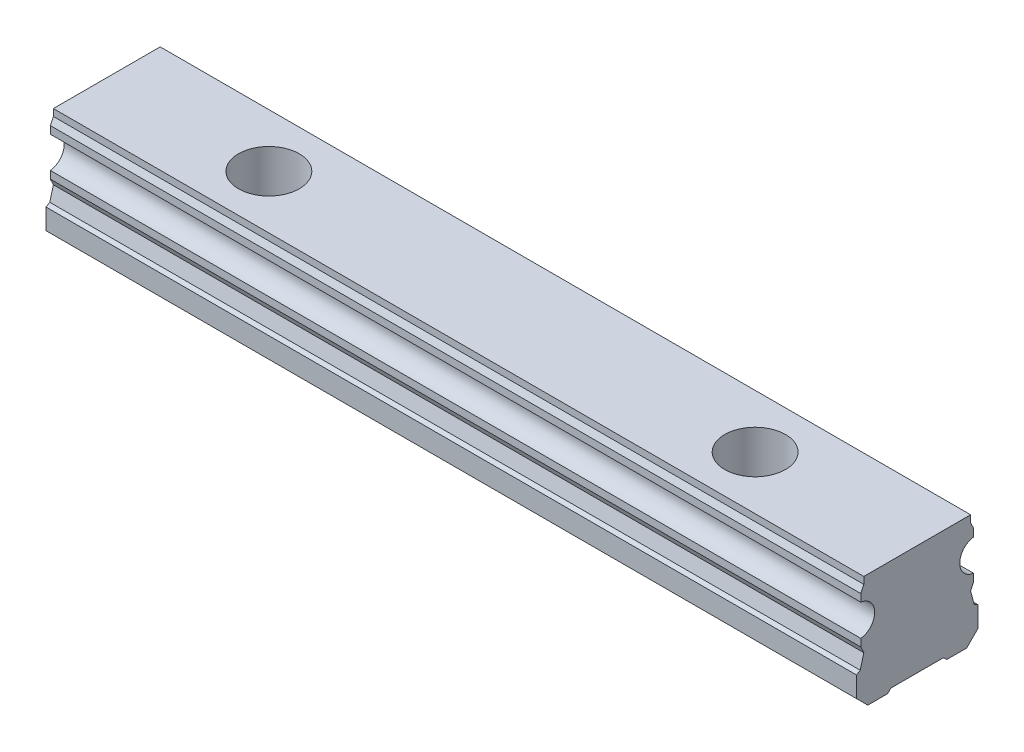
ISO-10303-21;
HEADER;
FILE_DESCRIPTION(('STEP AP214'),'2;1');
FILE_NAME('part.step','',(''),(''),'','','');
FILE_SCHEMA(('AUTOMOTIVE_DESIGN { 1 0 10303 214 1 1 1 1 }'));
ENDSEC;
DATA;
#1=APPLICATION_CONTEXT('core data for automotive mechanical design processes');
#2=APPLICATION_PROTOCOL_DEFINITION('international standard','automotive_design',2000,#1);
#3=PRODUCT_CONTEXT('',#1,'mechanical');
#4=PRODUCT('Part','Part','',(#3));
#5=PRODUCT_RELATED_PRODUCT_CATEGORY('part','',(#4));
#6=PRODUCT_DEFINITION_FORMATION('','',#4);
#7=PRODUCT_DEFINITION_CONTEXT('part definition',#1,'design');
#8=PRODUCT_DEFINITION('design','',#6,#7);
#9=PRODUCT_DEFINITION_SHAPE('','',#8);
#10=(LENGTH_UNIT() NAMED_UNIT(*) SI_UNIT(.MILLI.,.METRE.));
#11=(NAMED_UNIT(*) PLANE_ANGLE_UNIT() SI_UNIT($,.RADIAN.));
#12=(NAMED_UNIT(*) SI_UNIT($,.STERADIAN.) SOLID_ANGLE_UNIT());
#13=UNCERTAINTY_MEASURE_WITH_UNIT(LENGTH_MEASURE(1.E-05),#10,'distance_accuracy_value','');
#14=(GEOMETRIC_REPRESENTATION_CONTEXT(3) GLOBAL_UNCERTAINTY_ASSIGNED_CONTEXT((#13)) GLOBAL_UNIT_ASSIGNED_CONTEXT((#10,
#11,#12)) REPRESENTATION_CONTEXT('',''));
#15=CARTESIAN_POINT('',(0.,0.,0.));
#16=DIRECTION('',(0.,0.,1.));
#17=DIRECTION('',(1.,0.,0.));
#18=AXIS2_PLACEMENT_3D('',#15,#16,#17);
#19=CARTESIAN_POINT('',(100.,14.,-6.59000000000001));
#20=DIRECTION('',(0.,0.,1.));
#21=DIRECTION('',(0.,-1.,0.));
#22=AXIS2_PLACEMENT_3D('',#19,#20,#21);
#23=PLANE('',#22);
#24=DIRECTION('',(0.,1.,0.));
#25=VECTOR('',#24,1.);
#26=CARTESIAN_POINT('',(0.,14.,-6.59000000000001));
#27=LINE('',#26,#25);
#28=CARTESIAN_POINT('',(0.,13.15,-6.59));
#29=VERTEX_POINT('',#28);
#30=CARTESIAN_POINT('',(0.,14.,-6.59000000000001));
#31=VERTEX_POINT('',#30);
#32=EDGE_CURVE('E253',#29,#31,#27,.T.);
#33=ORIENTED_EDGE('',*,*,#32,.T.);
#34=DIRECTION('',(-1.,0.,0.));
#35=VECTOR('',#34,1.);
#36=CARTESIAN_POINT('',(100.,14.,-6.59000000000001));
#37=LINE('',#36,#35);
#38=CARTESIAN_POINT('',(100.,14.,-6.59000000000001));
#39=VERTEX_POINT('',#38);
#40=EDGE_CURVE('E421',#39,#31,#37,.T.);
#41=ORIENTED_EDGE('',*,*,#40,.F.);
#42=DIRECTION('',(0.,1.,0.));
#43=VECTOR('',#42,1.);
#44=CARTESIAN_POINT('',(100.,14.,-6.59000000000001));
#45=LINE('',#44,#43);
#46=CARTESIAN_POINT('',(100.,13.15,-6.59));
#47=VERTEX_POINT('',#46);
#48=EDGE_CURVE('E330',#47,#39,#45,.T.);
#49=ORIENTED_EDGE('',*,*,#48,.F.);
#50=DIRECTION('',(-1.,0.,0.));
#51=VECTOR('',#50,1.);
#52=CARTESIAN_POINT('',(100.,13.15,-6.59));
#53=LINE('',#52,#51);
#54=EDGE_CURVE('E249',#47,#29,#53,.T.);
#55=ORIENTED_EDGE('',*,*,#54,.T.);
#56=EDGE_LOOP('',(#33,#41,#49,#55));
#57=FACE_BOUND('',#56,.T.);
#58=ADVANCED_FACE('F38',(#57),#23,.F.);
#59=CARTESIAN_POINT('',(100.,14.,-6.59000000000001));
#60=DIRECTION('',(0.,-1.,0.));
#61=DIRECTION('',(0.,0.,-1.));
#62=AXIS2_PLACEMENT_3D('',#59,#60,#61);
#63=PLANE('',#62);
#64=CARTESIAN_POINT('',(80.,14.,0.));
#65=DIRECTION('',(0.,1.,0.));
#66=DIRECTION('',(0.,0.,1.));
#67=AXIS2_PLACEMENT_3D('',#64,#65,#66);
#68=CIRCLE('',#67,3.75);
#69=CARTESIAN_POINT('',(80.,14.,3.75));
#70=VERTEX_POINT('',#69);
#71=EDGE_CURVE('E603',#70,#70,#68,.T.);
#72=ORIENTED_EDGE('',*,*,#71,.F.);
#73=EDGE_LOOP('',(#72));
#74=FACE_BOUND('',#73,.T.);
#75=CARTESIAN_POINT('',(20.,14.,0.));
#76=DIRECTION('',(0.,1.,0.));
#77=DIRECTION('',(0.,0.,1.));
#78=AXIS2_PLACEMENT_3D('',#75,#76,#77);
#79=CIRCLE('',#78,3.75);
#80=CARTESIAN_POINT('',(20.,14.,3.75));
#81=VERTEX_POINT('',#80);
#82=EDGE_CURVE('E616',#81,#81,#79,.T.);
#83=ORIENTED_EDGE('',*,*,#82,.F.);
#84=EDGE_LOOP('',(#83));
#85=FACE_BOUND('',#84,.T.);
#86=DIRECTION('',(0.,0.,1.));
#87=VECTOR('',#86,1.);
#88=CARTESIAN_POINT('',(0.,14.,-6.59000000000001));
#89=LINE('',#88,#87);
#90=CARTESIAN_POINT('',(0.,14.,6.59));
#91=VERTEX_POINT('',#90);
#92=EDGE_CURVE('E257',#31,#91,#89,.T.);
#93=ORIENTED_EDGE('',*,*,#92,.T.);
#94=DIRECTION('',(-1.,0.,0.));
#95=VECTOR('',#94,1.);
#96=CARTESIAN_POINT('',(100.,14.,6.59));
#97=LINE('',#96,#95);
#98=CARTESIAN_POINT('',(100.,14.,6.59));
#99=VERTEX_POINT('',#98);
#100=EDGE_CURVE('E417',#99,#91,#97,.T.);
#101=ORIENTED_EDGE('',*,*,#100,.F.);
#102=DIRECTION('',(0.,0.,1.));
#103=VECTOR('',#102,1.);
#104=CARTESIAN_POINT('',(100.,14.,-6.59000000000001));
#105=LINE('',#104,#103);
#106=EDGE_CURVE('E155',#39,#99,#105,.T.);
#107=ORIENTED_EDGE('',*,*,#106,.F.);
#108=ORIENTED_EDGE('',*,*,#40,.T.);
#109=EDGE_LOOP('',(#93,#101,#107,#108));
#110=FACE_BOUND('',#109,.T.);
#111=ADVANCED_FACE('F450',(#74,#85,#110),#63,.F.);
#112=CARTESIAN_POINT('',(100.,14.,6.59));
#113=DIRECTION('',(0.,0.,-1.));
#114=DIRECTION('',(0.,1.,0.));
#115=AXIS2_PLACEMENT_3D('',#112,#113,#114);
#116=PLANE('',#115);
#117=DIRECTION('',(0.,-1.,0.));
#118=VECTOR('',#117,1.);
#119=CARTESIAN_POINT('',(0.,14.,6.59));
#120=LINE('',#119,#118);
#121=CARTESIAN_POINT('',(0.,13.15,6.59));
#122=VERTEX_POINT('',#121);
#123=EDGE_CURVE('E261',#91,#122,#120,.T.);
#124=ORIENTED_EDGE('',*,*,#123,.T.);
#125=DIRECTION('',(-1.,0.,0.));
#126=VECTOR('',#125,1.);
#127=CARTESIAN_POINT('',(100.,13.15,6.59));
#128=LINE('',#127,#126);
#129=CARTESIAN_POINT('',(100.,13.15,6.59));
#130=VERTEX_POINT('',#129);
#131=EDGE_CURVE('E413',#130,#122,#128,.T.);
#132=ORIENTED_EDGE('',*,*,#131,.F.);
#133=DIRECTION('',(0.,-1.,0.));
#134=VECTOR('',#133,1.);
#135=CARTESIAN_POINT('',(100.,14.,6.59));
#136=LINE('',#135,#134);
#137=EDGE_CURVE('E537',#99,#130,#136,.T.);
#138=ORIENTED_EDGE('',*,*,#137,.F.);
#139=ORIENTED_EDGE('',*,*,#100,.T.);
#140=EDGE_LOOP('',(#124,#132,#138,#139));
#141=FACE_BOUND('',#140,.T.);
#142=ADVANCED_FACE('F456',(#141),#116,.F.);
#143=CARTESIAN_POINT('',(100.,13.15,6.59));
#144=DIRECTION('',(0.,-0.422618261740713,-0.906307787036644));
#145=DIRECTION('',(0.,0.906307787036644,-0.422618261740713));
#146=AXIS2_PLACEMENT_3D('',#143,#144,#145);
#147=PLANE('',#146);
#148=DIRECTION('',(0.,-0.906307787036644,0.422618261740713));
#149=VECTOR('',#148,1.);
#150=CARTESIAN_POINT('',(0.,13.15,6.59));
#151=LINE('',#150,#149);
#152=CARTESIAN_POINT('',(0.,12.3565324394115,6.96));
#153=VERTEX_POINT('',#152);
#154=EDGE_CURVE('E264',#122,#153,#151,.T.);
#155=ORIENTED_EDGE('',*,*,#154,.T.);
#156=DIRECTION('',(-1.,0.,0.));
#157=VECTOR('',#156,1.);
#158=CARTESIAN_POINT('',(100.,12.3565324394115,6.96));
#159=LINE('',#158,#157);
#160=CARTESIAN_POINT('',(100.,12.3565324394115,6.96));
#161=VERTEX_POINT('',#160);
#162=EDGE_CURVE('E409',#161,#153,#159,.T.);
#163=ORIENTED_EDGE('',*,*,#162,.F.);
#164=DIRECTION('',(0.,-0.906307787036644,0.422618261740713));
#165=VECTOR('',#164,1.);
#166=CARTESIAN_POINT('',(100.,13.15,6.59));
#167=LINE('',#166,#165);
#168=EDGE_CURVE('E539',#130,#161,#167,.T.);
#169=ORIENTED_EDGE('',*,*,#168,.F.);
#170=ORIENTED_EDGE('',*,*,#131,.T.);
#171=EDGE_LOOP('',(#155,#163,#169,#170));
#172=FACE_BOUND('',#171,.T.);
#173=ADVANCED_FACE('F681',(#172),#147,.F.);
#174=CARTESIAN_POINT('',(100.,12.3565324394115,6.96));
#175=DIRECTION('',(0.,0.,-1.));
#176=DIRECTION('',(0.,1.,0.));
#177=AXIS2_PLACEMENT_3D('',#174,#175,#176);
#178=PLANE('',#177);
#179=DIRECTION('',(0.,-1.,0.));
#180=VECTOR('',#179,1.);
#181=CARTESIAN_POINT('',(0.,12.3565324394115,6.96));
#182=LINE('',#181,#180);
#183=CARTESIAN_POINT('',(0.,11.4351744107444,6.96));
#184=VERTEX_POINT('',#183);
#185=EDGE_CURVE('E267',#153,#184,#182,.T.);
#186=ORIENTED_EDGE('',*,*,#185,.T.);
#187=DIRECTION('',(-1.,0.,0.));
#188=VECTOR('',#187,1.);
#189=CARTESIAN_POINT('',(100.,11.4351744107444,6.96));
#190=LINE('',#189,#188);
#191=CARTESIAN_POINT('',(100.,11.4351744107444,6.96));
#192=VERTEX_POINT('',#191);
#193=EDGE_CURVE('E405',#192,#184,#190,.T.);
#194=ORIENTED_EDGE('',*,*,#193,.F.);
#195=DIRECTION('',(0.,-1.,0.));
#196=VECTOR('',#195,1.);
#197=CARTESIAN_POINT('',(100.,12.3565324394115,6.96));
#198=LINE('',#197,#196);
#199=EDGE_CURVE('E541',#161,#192,#198,.T.);
#200=ORIENTED_EDGE('',*,*,#199,.F.);
#201=ORIENTED_EDGE('',*,*,#162,.T.);
#202=EDGE_LOOP('',(#186,#194,#200,#201));
#203=FACE_BOUND('',#202,.T.);
#204=ADVANCED_FACE('F676',(#203),#178,.F.);
#205=CARTESIAN_POINT('',(100.,9.5,7.2));
#206=DIRECTION('',(-1.,0.,0.));
#207=DIRECTION('',(0.,0.,1.));
#208=AXIS2_PLACEMENT_3D('',#205,#206,#207);
#209=CYLINDRICAL_SURFACE('',#208,1.95);
#210=CARTESIAN_POINT('',(0.,9.5,7.2));
#211=DIRECTION('',(-1.,0.,0.));
#212=DIRECTION('',(0.,0.,-1.));
#213=AXIS2_PLACEMENT_3D('',#210,#211,#212);
#214=CIRCLE('',#213,1.95);
#215=CARTESIAN_POINT('',(0.,7.56482558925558,6.96));
#216=VERTEX_POINT('',#215);
#217=EDGE_CURVE('E270',#184,#216,#214,.T.);
#218=ORIENTED_EDGE('',*,*,#217,.T.);
#219=DIRECTION('',(-1.,0.,0.));
#220=VECTOR('',#219,1.);
#221=CARTESIAN_POINT('',(100.,7.56482558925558,6.96));
#222=LINE('',#221,#220);
#223=CARTESIAN_POINT('',(100.,7.56482558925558,6.96));
#224=VERTEX_POINT('',#223);
#225=EDGE_CURVE('E401',#224,#216,#222,.T.);
#226=ORIENTED_EDGE('',*,*,#225,.F.);
#227=CARTESIAN_POINT('',(100.,9.5,7.2));
#228=DIRECTION('',(-1.,0.,0.));
#229=DIRECTION('',(0.,0.,-1.));
#230=AXIS2_PLACEMENT_3D('',#227,#228,#229);
#231=CIRCLE('',#230,1.95);
#232=EDGE_CURVE('E543',#192,#224,#231,.T.);
#233=ORIENTED_EDGE('',*,*,#232,.F.);
#234=ORIENTED_EDGE('',*,*,#193,.T.);
#235=EDGE_LOOP('',(#218,#226,#233,#234));
#236=FACE_BOUND('',#235,.T.);
#237=ADVANCED_FACE('F670',(#236),#209,.F.);
#238=CARTESIAN_POINT('',(100.,7.56482558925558,6.96));
#239=DIRECTION('',(0.,0.,-1.));
#240=DIRECTION('',(0.,1.,0.));
#241=AXIS2_PLACEMENT_3D('',#238,#239,#240);
#242=PLANE('',#241);
#243=DIRECTION('',(0.,-1.,0.));
#244=VECTOR('',#243,1.);
#245=CARTESIAN_POINT('',(0.,7.56482558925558,6.96));
#246=LINE('',#245,#244);
#247=CARTESIAN_POINT('',(0.,6.64346756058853,6.96));
#248=VERTEX_POINT('',#247);
#249=EDGE_CURVE('E273',#216,#248,#246,.T.);
#250=ORIENTED_EDGE('',*,*,#249,.T.);
#251=DIRECTION('',(-1.,0.,0.));
#252=VECTOR('',#251,1.);
#253=CARTESIAN_POINT('',(100.,6.64346756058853,6.96));
#254=LINE('',#253,#252);
#255=CARTESIAN_POINT('',(100.,6.64346756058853,6.96));
#256=VERTEX_POINT('',#255);
#257=EDGE_CURVE('E397',#256,#248,#254,.T.);
#258=ORIENTED_EDGE('',*,*,#257,.F.);
#259=DIRECTION('',(0.,-1.,0.));
#260=VECTOR('',#259,1.);
#261=CARTESIAN_POINT('',(100.,7.56482558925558,6.96));
#262=LINE('',#261,#260);
#263=EDGE_CURVE('E557',#224,#256,#262,.T.);
#264=ORIENTED_EDGE('',*,*,#263,.F.);
#265=ORIENTED_EDGE('',*,*,#225,.T.);
#266=EDGE_LOOP('',(#250,#258,#264,#265));
#267=FACE_BOUND('',#266,.T.);
#268=ADVANCED_FACE('F666',(#267),#242,.F.);
#269=CARTESIAN_POINT('',(100.,6.64346756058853,6.96));
#270=DIRECTION('',(0.,0.422618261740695,-0.906307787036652));
#271=DIRECTION('',(0.,0.906307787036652,0.422618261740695));
#272=AXIS2_PLACEMENT_3D('',#269,#270,#271);
#273=PLANE('',#272);
#274=DIRECTION('',(0.,-0.906307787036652,-0.422618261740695));
#275=VECTOR('',#274,1.);
#276=CARTESIAN_POINT('',(0.,6.64346756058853,6.96));
#277=LINE('',#276,#275);
#278=CARTESIAN_POINT('',(0.,5.85,6.59000000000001));
#279=VERTEX_POINT('',#278);
#280=EDGE_CURVE('E276',#248,#279,#277,.T.);
#281=ORIENTED_EDGE('',*,*,#280,.T.);
#282=DIRECTION('',(-1.,0.,0.));
#283=VECTOR('',#282,1.);
#284=CARTESIAN_POINT('',(100.,5.85,6.59000000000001));
#285=LINE('',#284,#283);
#286=CARTESIAN_POINT('',(100.,5.85,6.59000000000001));
#287=VERTEX_POINT('',#286);
#288=EDGE_CURVE('E393',#287,#279,#285,.T.);
#289=ORIENTED_EDGE('',*,*,#288,.F.);
#290=DIRECTION('',(0.,-0.906307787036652,-0.422618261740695));
#291=VECTOR('',#290,1.);
#292=CARTESIAN_POINT('',(100.,6.64346756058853,6.96));
#293=LINE('',#292,#291);
#294=EDGE_CURVE('E556',#256,#287,#293,.T.);
#295=ORIENTED_EDGE('',*,*,#294,.F.);
#296=ORIENTED_EDGE('',*,*,#257,.T.);
#297=EDGE_LOOP('',(#281,#289,#295,#296));
#298=FACE_BOUND('',#297,.T.);
#299=ADVANCED_FACE('F661',(#298),#273,.F.);
#300=CARTESIAN_POINT('',(100.,5.85,6.59000000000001));
#301=DIRECTION('',(0.,-0.25881904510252,-0.965925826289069));
#302=DIRECTION('',(0.,0.965925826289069,-0.25881904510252));
#303=AXIS2_PLACEMENT_3D('',#300,#301,#302);
#304=PLANE('',#303);
#305=DIRECTION('',(0.,-0.965925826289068,0.25881904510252));
#306=VECTOR('',#305,1.);
#307=CARTESIAN_POINT('',(0.,5.85,6.59000000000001));
#308=LINE('',#307,#306);
#309=CARTESIAN_POINT('',(0.,4.2,7.03211616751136));
#310=VERTEX_POINT('',#309);
#311=EDGE_CURVE('E279',#279,#310,#308,.T.);
#312=ORIENTED_EDGE('',*,*,#311,.T.);
#313=DIRECTION('',(-1.,0.,0.));
#314=VECTOR('',#313,1.);
#315=CARTESIAN_POINT('',(100.,4.2,7.03211616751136));
#316=LINE('',#315,#314);
#317=CARTESIAN_POINT('',(100.,4.2,7.03211616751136));
#318=VERTEX_POINT('',#317);
#319=EDGE_CURVE('E389',#318,#310,#316,.T.);
#320=ORIENTED_EDGE('',*,*,#319,.F.);
#321=DIRECTION('',(0.,-0.965925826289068,0.25881904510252));
#322=VECTOR('',#321,1.);
#323=CARTESIAN_POINT('',(100.,5.85,6.59000000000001));
#324=LINE('',#323,#322);
#325=EDGE_CURVE('E547',#287,#318,#324,.T.);
#326=ORIENTED_EDGE('',*,*,#325,.F.);
#327=ORIENTED_EDGE('',*,*,#288,.T.);
#328=EDGE_LOOP('',(#312,#320,#326,#327));
#329=FACE_BOUND('',#328,.T.);
#330=ADVANCED_FACE('F655',(#329),#304,.F.);
#331=CARTESIAN_POINT('',(100.,4.2,7.03211616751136));
#332=DIRECTION('',(0.,-0.866025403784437,-0.500000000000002));
#333=DIRECTION('',(0.,0.500000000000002,-0.866025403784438));
#334=AXIS2_PLACEMENT_3D('',#331,#332,#333);
#335=PLANE('',#334);
#336=DIRECTION('',(0.,-0.500000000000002,0.866025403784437));
#337=VECTOR('',#336,1.);
#338=CARTESIAN_POINT('',(0.,4.2,7.03211616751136));
#339=LINE('',#338,#337);
#340=CARTESIAN_POINT('',(0.,3.92986714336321,7.5));
#341=VERTEX_POINT('',#340);
#342=EDGE_CURVE('E282',#310,#341,#339,.T.);
#343=ORIENTED_EDGE('',*,*,#342,.T.);
#344=DIRECTION('',(-1.,0.,0.));
#345=VECTOR('',#344,1.);
#346=CARTESIAN_POINT('',(100.,3.92986714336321,7.5));
#347=LINE('',#346,#345);
#348=CARTESIAN_POINT('',(100.,3.92986714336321,7.5));
#349=VERTEX_POINT('',#348);
#350=EDGE_CURVE('E385',#349,#341,#347,.T.);
#351=ORIENTED_EDGE('',*,*,#350,.F.);
#352=DIRECTION('',(0.,-0.500000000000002,0.866025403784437));
#353=VECTOR('',#352,1.);
#354=CARTESIAN_POINT('',(100.,4.2,7.03211616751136));
#355=LINE('',#354,#353);
#356=EDGE_CURVE('E545',#318,#349,#355,.T.);
#357=ORIENTED_EDGE('',*,*,#356,.F.);
#358=ORIENTED_EDGE('',*,*,#319,.T.);
#359=EDGE_LOOP('',(#343,#351,#357,#358));
#360=FACE_BOUND('',#359,.T.);
#361=ADVANCED_FACE('F651',(#360),#335,.F.);
#362=CARTESIAN_POINT('',(100.,3.92986714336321,7.5));
#363=DIRECTION('',(0.,0.,-1.));
#364=DIRECTION('',(0.,1.,0.));
#365=AXIS2_PLACEMENT_3D('',#362,#363,#364);
#366=PLANE('',#365);
#367=DIRECTION('',(0.,-1.,0.));
#368=VECTOR('',#367,1.);
#369=CARTESIAN_POINT('',(0.,3.92986714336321,7.5));
#370=LINE('',#369,#368);
#371=CARTESIAN_POINT('',(0.,1.4,7.5));
#372=VERTEX_POINT('',#371);
#373=EDGE_CURVE('E285',#341,#372,#370,.T.);
#374=ORIENTED_EDGE('',*,*,#373,.T.);
#375=DIRECTION('',(-1.,0.,0.));
#376=VECTOR('',#375,1.);
#377=CARTESIAN_POINT('',(100.,1.4,7.5));
#378=LINE('',#377,#376);
#379=CARTESIAN_POINT('',(100.,1.4,7.5));
#380=VERTEX_POINT('',#379);
#381=EDGE_CURVE('E381',#380,#372,#378,.T.);
#382=ORIENTED_EDGE('',*,*,#381,.F.);
#383=DIRECTION('',(0.,-1.,0.));
#384=VECTOR('',#383,1.);
#385=CARTESIAN_POINT('',(100.,3.92986714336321,7.5));
#386=LINE('',#385,#384);
#387=EDGE_CURVE('E546',#349,#380,#386,.T.);
#388=ORIENTED_EDGE('',*,*,#387,.F.);
#389=ORIENTED_EDGE('',*,*,#350,.T.);
#390=EDGE_LOOP('',(#374,#382,#388,#389));
#391=FACE_BOUND('',#390,.T.);
#392=ADVANCED_FACE('F647',(#391),#366,.F.);
#393=CARTESIAN_POINT('',(100.,1.4,7.5));
#394=DIRECTION('',(0.,0.70710678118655,-0.707106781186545));
#395=DIRECTION('',(0.,0.707106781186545,0.70710678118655));
#396=AXIS2_PLACEMENT_3D('',#393,#394,#395);
#397=PLANE('',#396);
#398=DIRECTION('',(0.,-0.707106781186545,-0.70710678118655));
#399=VECTOR('',#398,1.);
#400=CARTESIAN_POINT('',(0.,1.4,7.5));
#401=LINE('',#400,#399);
#402=CARTESIAN_POINT('',(0.,0.,6.1));
#403=VERTEX_POINT('',#402);
#404=EDGE_CURVE('E288',#372,#403,#401,.T.);
#405=ORIENTED_EDGE('',*,*,#404,.T.);
#406=DIRECTION('',(-1.,0.,0.));
#407=VECTOR('',#406,1.);
#408=CARTESIAN_POINT('',(100.,0.,6.1));
#409=LINE('',#408,#407);
#410=CARTESIAN_POINT('',(100.,0.,6.1));
#411=VERTEX_POINT('',#410);
#412=EDGE_CURVE('E377',#411,#403,#409,.T.);
#413=ORIENTED_EDGE('',*,*,#412,.F.);
#414=DIRECTION('',(0.,-0.707106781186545,-0.70710678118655));
#415=VECTOR('',#414,1.);
#416=CARTESIAN_POINT('',(100.,1.4,7.5));
#417=LINE('',#416,#415);
#418=EDGE_CURVE('E572',#380,#411,#417,.T.);
#419=ORIENTED_EDGE('',*,*,#418,.F.);
#420=ORIENTED_EDGE('',*,*,#381,.T.);
#421=EDGE_LOOP('',(#405,#413,#419,#420));
#422=FACE_BOUND('',#421,.T.);
#423=ADVANCED_FACE('F636',(#422),#397,.F.);
#424=CARTESIAN_POINT('',(100.,0.,6.1));
#425=DIRECTION('',(0.,1.,0.));
#426=DIRECTION('',(0.,0.,1.));
#427=AXIS2_PLACEMENT_3D('',#424,#425,#426);
#428=PLANE('',#427);
#429=DIRECTION('',(0.,0.,-1.));
#430=VECTOR('',#429,1.);
#431=CARTESIAN_POINT('',(0.,0.,6.1));
#432=LINE('',#431,#430);
#433=CARTESIAN_POINT('',(0.,0.,3.65));
#434=VERTEX_POINT('',#433);
#435=EDGE_CURVE('E291',#403,#434,#432,.T.);
#436=ORIENTED_EDGE('',*,*,#435,.T.);
#437=DIRECTION('',(-1.,0.,0.));
#438=VECTOR('',#437,1.);
#439=CARTESIAN_POINT('',(100.,0.,3.65));
#440=LINE('',#439,#438);
#441=CARTESIAN_POINT('',(100.,0.,3.65));
#442=VERTEX_POINT('',#441);
#443=EDGE_CURVE('E373',#442,#434,#440,.T.);
#444=ORIENTED_EDGE('',*,*,#443,.F.);
#445=DIRECTION('',(0.,0.,-1.));
#446=VECTOR('',#445,1.);
#447=CARTESIAN_POINT('',(100.,0.,6.1));
#448=LINE('',#447,#446);
#449=EDGE_CURVE('E574',#411,#442,#448,.T.);
#450=ORIENTED_EDGE('',*,*,#449,.F.);
#451=ORIENTED_EDGE('',*,*,#412,.T.);
#452=EDGE_LOOP('',(#436,#444,#450,#451));
#453=FACE_BOUND('',#452,.T.);
#454=ADVANCED_FACE('F640',(#453),#428,.F.);
#455=CARTESIAN_POINT('',(100.,0.,3.65));
#456=DIRECTION('',(0.,0.707106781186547,0.707106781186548));
#457=DIRECTION('',(0.,-0.707106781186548,0.707106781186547));
#458=AXIS2_PLACEMENT_3D('',#455,#456,#457);
#459=PLANE('',#458);
#460=DIRECTION('',(0.,0.707106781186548,-0.707106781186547));
#461=VECTOR('',#460,1.);
#462=CARTESIAN_POINT('',(0.,0.,3.65));
#463=LINE('',#462,#461);
#464=CARTESIAN_POINT('',(0.,0.399999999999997,3.25));
#465=VERTEX_POINT('',#464);
#466=EDGE_CURVE('E294',#434,#465,#463,.T.);
#467=ORIENTED_EDGE('',*,*,#466,.T.);
#468=DIRECTION('',(-1.,0.,0.));
#469=VECTOR('',#468,1.);
#470=CARTESIAN_POINT('',(100.,0.399999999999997,3.25));
#471=LINE('',#470,#469);
#472=CARTESIAN_POINT('',(100.,0.399999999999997,3.25));
#473=VERTEX_POINT('',#472);
#474=EDGE_CURVE('E369',#473,#465,#471,.T.);
#475=ORIENTED_EDGE('',*,*,#474,.F.);
#476=DIRECTION('',(0.,0.707106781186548,-0.707106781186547));
#477=VECTOR('',#476,1.);
#478=CARTESIAN_POINT('',(100.,0.,3.65));
#479=LINE('',#478,#477);
#480=EDGE_CURVE('E561',#442,#473,#479,.T.);
#481=ORIENTED_EDGE('',*,*,#480,.F.);
#482=ORIENTED_EDGE('',*,*,#443,.T.);
#483=EDGE_LOOP('',(#467,#475,#481,#482));
#484=FACE_BOUND('',#483,.T.);
#485=ADVANCED_FACE('F481',(#484),#459,.F.);
#486=CARTESIAN_POINT('',(100.,0.399999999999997,3.25));
#487=DIRECTION('',(0.,1.,0.));
#488=DIRECTION('',(0.,0.,1.));
#489=AXIS2_PLACEMENT_3D('',#486,#487,#488);
#490=PLANE('',#489);
#491=CARTESIAN_POINT('',(70.,0.399999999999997,0.));
#492=DIRECTION('',(0.,1.,0.));
#493=DIRECTION('',(0.,0.,1.));
#494=AXIS2_PLACEMENT_3D('',#491,#492,#493);
#495=CIRCLE('',#494,2.89999999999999);
#496=CARTESIAN_POINT('',(70.,0.399999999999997,2.89999999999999));
#497=VERTEX_POINT('',#496);
#498=EDGE_CURVE('E48',#497,#497,#495,.T.);
#499=ORIENTED_EDGE('',*,*,#498,.T.);
#500=EDGE_LOOP('',(#499));
#501=FACE_BOUND('',#500,.T.);
#502=CARTESIAN_POINT('',(10.,0.399999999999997,0.));
#503=DIRECTION('',(0.,1.,0.));
#504=DIRECTION('',(0.,0.,1.));
#505=AXIS2_PLACEMENT_3D('',#502,#503,#504);
#506=CIRCLE('',#505,2.89999999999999);
#507=CARTESIAN_POINT('',(10.,0.399999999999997,2.89999999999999));
#508=VERTEX_POINT('',#507);
#509=EDGE_CURVE('E424',#508,#508,#506,.T.);
#510=ORIENTED_EDGE('',*,*,#509,.T.);
#511=EDGE_LOOP('',(#510));
#512=FACE_BOUND('',#511,.T.);
#513=CARTESIAN_POINT('',(80.,0.399999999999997,0.));
#514=DIRECTION('',(0.,1.,0.));
#515=DIRECTION('',(0.,0.,1.));
#516=AXIS2_PLACEMENT_3D('',#513,#514,#515);
#517=CIRCLE('',#516,2.2);
#518=CARTESIAN_POINT('',(80.,0.399999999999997,2.2));
#519=VERTEX_POINT('',#518);
#520=EDGE_CURVE('E486',#519,#519,#517,.T.);
#521=ORIENTED_EDGE('',*,*,#520,.T.);
#522=EDGE_LOOP('',(#521));
#523=FACE_BOUND('',#522,.T.);
#524=CARTESIAN_POINT('',(20.,0.399999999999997,0.));
#525=DIRECTION('',(0.,1.,0.));
#526=DIRECTION('',(0.,0.,1.));
#527=AXIS2_PLACEMENT_3D('',#524,#525,#526);
#528=CIRCLE('',#527,2.2);
#529=CARTESIAN_POINT('',(20.,0.399999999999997,2.2));
#530=VERTEX_POINT('',#529);
#531=EDGE_CURVE('E490',#530,#530,#528,.T.);
#532=ORIENTED_EDGE('',*,*,#531,.T.);
#533=EDGE_LOOP('',(#532));
#534=FACE_BOUND('',#533,.T.);
#535=DIRECTION('',(0.,0.,-1.));
#536=VECTOR('',#535,1.);
#537=CARTESIAN_POINT('',(0.,0.399999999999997,3.25));
#538=LINE('',#537,#536);
#539=CARTESIAN_POINT('',(0.,0.399999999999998,-3.25));
#540=VERTEX_POINT('',#539);
#541=EDGE_CURVE('E297',#465,#540,#538,.T.);
#542=ORIENTED_EDGE('',*,*,#541,.T.);
#543=DIRECTION('',(-1.,0.,0.));
#544=VECTOR('',#543,1.);
#545=CARTESIAN_POINT('',(100.,0.399999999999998,-3.25));
#546=LINE('',#545,#544);
#547=CARTESIAN_POINT('',(100.,0.399999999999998,-3.25));
#548=VERTEX_POINT('',#547);
#549=EDGE_CURVE('E365',#548,#540,#546,.T.);
#550=ORIENTED_EDGE('',*,*,#549,.F.);
#551=DIRECTION('',(0.,0.,-1.));
#552=VECTOR('',#551,1.);
#553=CARTESIAN_POINT('',(100.,0.399999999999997,3.25));
#554=LINE('',#553,#552);
#555=EDGE_CURVE('E560',#473,#548,#554,.T.);
#556=ORIENTED_EDGE('',*,*,#555,.F.);
#557=ORIENTED_EDGE('',*,*,#474,.T.);
#558=EDGE_LOOP('',(#542,#550,#556,#557));
#559=FACE_BOUND('',#558,.T.);
#560=ADVANCED_FACE('F436',(#501,#512,#523,#534,#559),#490,.F.);
#561=CARTESIAN_POINT('',(100.,0.399999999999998,-3.25));
#562=DIRECTION('',(0.,0.707106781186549,-0.707106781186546));
#563=DIRECTION('',(0.,0.707106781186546,0.707106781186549));
#564=AXIS2_PLACEMENT_3D('',#561,#562,#563);
#565=PLANE('',#564);
#566=DIRECTION('',(0.,-0.707106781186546,-0.707106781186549));
#567=VECTOR('',#566,1.);
#568=CARTESIAN_POINT('',(0.,0.399999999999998,-3.25));
#569=LINE('',#568,#567);
#570=CARTESIAN_POINT('',(0.,0.,-3.65));
#571=VERTEX_POINT('',#570);
#572=EDGE_CURVE('E300',#540,#571,#569,.T.);
#573=ORIENTED_EDGE('',*,*,#572,.T.);
#574=DIRECTION('',(-1.,0.,0.));
#575=VECTOR('',#574,1.);
#576=CARTESIAN_POINT('',(100.,0.,-3.65));
#577=LINE('',#576,#575);
#578=CARTESIAN_POINT('',(100.,0.,-3.65));
#579=VERTEX_POINT('',#578);
#580=EDGE_CURVE('E361',#579,#571,#577,.T.);
#581=ORIENTED_EDGE('',*,*,#580,.F.);
#582=DIRECTION('',(0.,-0.707106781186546,-0.707106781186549));
#583=VECTOR('',#582,1.);
#584=CARTESIAN_POINT('',(100.,0.399999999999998,-3.25));
#585=LINE('',#584,#583);
#586=EDGE_CURVE('E501',#548,#579,#585,.T.);
#587=ORIENTED_EDGE('',*,*,#586,.F.);
#588=ORIENTED_EDGE('',*,*,#549,.T.);
#589=EDGE_LOOP('',(#573,#581,#587,#588));
#590=FACE_BOUND('',#589,.T.);
#591=ADVANCED_FACE('F480',(#590),#565,.F.);
#592=CARTESIAN_POINT('',(100.,0.,-3.65));
#593=DIRECTION('',(0.,1.,0.));
#594=DIRECTION('',(0.,0.,1.));
#595=AXIS2_PLACEMENT_3D('',#592,#593,#594);
#596=PLANE('',#595);
#597=DIRECTION('',(0.,0.,-1.));
#598=VECTOR('',#597,1.);
#599=CARTESIAN_POINT('',(0.,0.,-3.65));
#600=LINE('',#599,#598);
#601=CARTESIAN_POINT('',(0.,0.,-6.1));
#602=VERTEX_POINT('',#601);
#603=EDGE_CURVE('E303',#571,#602,#600,.T.);
#604=ORIENTED_EDGE('',*,*,#603,.T.);
#605=DIRECTION('',(-1.,0.,0.));
#606=VECTOR('',#605,1.);
#607=CARTESIAN_POINT('',(100.,0.,-6.1));
#608=LINE('',#607,#606);
#609=CARTESIAN_POINT('',(100.,0.,-6.1));
#610=VERTEX_POINT('',#609);
#611=EDGE_CURVE('E357',#610,#602,#608,.T.);
#612=ORIENTED_EDGE('',*,*,#611,.F.);
#613=DIRECTION('',(0.,0.,-1.));
#614=VECTOR('',#613,1.);
#615=CARTESIAN_POINT('',(100.,0.,-3.65));
#616=LINE('',#615,#614);
#617=EDGE_CURVE('E519',#579,#610,#616,.T.);
#618=ORIENTED_EDGE('',*,*,#617,.F.);
#619=ORIENTED_EDGE('',*,*,#580,.T.);
#620=EDGE_LOOP('',(#604,#612,#618,#619));
#621=FACE_BOUND('',#620,.T.);
#622=ADVANCED_FACE('F509',(#621),#596,.F.);
#623=CARTESIAN_POINT('',(100.,0.,-6.1));
#624=DIRECTION('',(0.,0.707106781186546,0.707106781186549));
#625=DIRECTION('',(0.,-0.707106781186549,0.707106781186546));
#626=AXIS2_PLACEMENT_3D('',#623,#624,#625);
#627=PLANE('',#626);
#628=DIRECTION('',(0.,0.707106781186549,-0.707106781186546));
#629=VECTOR('',#628,1.);
#630=CARTESIAN_POINT('',(0.,0.,-6.1));
#631=LINE('',#630,#629);
#632=CARTESIAN_POINT('',(0.,1.4,-7.5));
#633=VERTEX_POINT('',#632);
#634=EDGE_CURVE('E306',#602,#633,#631,.T.);
#635=ORIENTED_EDGE('',*,*,#634,.T.);
#636=DIRECTION('',(-1.,0.,0.));
#637=VECTOR('',#636,1.);
#638=CARTESIAN_POINT('',(100.,1.4,-7.5));
#639=LINE('',#638,#637);
#640=CARTESIAN_POINT('',(100.,1.4,-7.5));
#641=VERTEX_POINT('',#640);
#642=EDGE_CURVE('E353',#641,#633,#639,.T.);
#643=ORIENTED_EDGE('',*,*,#642,.F.);
#644=DIRECTION('',(0.,0.707106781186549,-0.707106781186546));
#645=VECTOR('',#644,1.);
#646=CARTESIAN_POINT('',(100.,0.,-6.1));
#647=LINE('',#646,#645);
#648=EDGE_CURVE('E515',#610,#641,#647,.T.);
#649=ORIENTED_EDGE('',*,*,#648,.F.);
#650=ORIENTED_EDGE('',*,*,#611,.T.);
#651=EDGE_LOOP('',(#635,#643,#649,#650));
#652=FACE_BOUND('',#651,.T.);
#653=ADVANCED_FACE('F513',(#652),#627,.F.);
#654=CARTESIAN_POINT('',(100.,1.4,-7.5));
#655=DIRECTION('',(0.,0.,1.));
#656=DIRECTION('',(0.,-1.,0.));
#657=AXIS2_PLACEMENT_3D('',#654,#655,#656);
#658=PLANE('',#657);
#659=DIRECTION('',(0.,1.,0.));
#660=VECTOR('',#659,1.);
#661=CARTESIAN_POINT('',(0.,1.4,-7.5));
#662=LINE('',#661,#660);
#663=CARTESIAN_POINT('',(0.,3.92986714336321,-7.5));
#664=VERTEX_POINT('',#663);
#665=EDGE_CURVE('E309',#633,#664,#662,.T.);
#666=ORIENTED_EDGE('',*,*,#665,.T.);
#667=DIRECTION('',(-1.,0.,0.));
#668=VECTOR('',#667,1.);
#669=CARTESIAN_POINT('',(100.,3.92986714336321,-7.5));
#670=LINE('',#669,#668);
#671=CARTESIAN_POINT('',(100.,3.92986714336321,-7.5));
#672=VERTEX_POINT('',#671);
#673=EDGE_CURVE('E349',#672,#664,#670,.T.);
#674=ORIENTED_EDGE('',*,*,#673,.F.);
#675=DIRECTION('',(0.,1.,0.));
#676=VECTOR('',#675,1.);
#677=CARTESIAN_POINT('',(100.,1.4,-7.5));
#678=LINE('',#677,#676);
#679=EDGE_CURVE('E518',#641,#672,#678,.T.);
#680=ORIENTED_EDGE('',*,*,#679,.F.);
#681=ORIENTED_EDGE('',*,*,#642,.T.);
#682=EDGE_LOOP('',(#666,#674,#680,#681));
#683=FACE_BOUND('',#682,.T.);
#684=ADVANCED_FACE('F708',(#683),#658,.F.);
#685=CARTESIAN_POINT('',(100.,3.92986714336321,-7.5));
#686=DIRECTION('',(0.,-0.866025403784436,0.500000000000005));
#687=DIRECTION('',(0.,-0.500000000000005,-0.866025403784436));
#688=AXIS2_PLACEMENT_3D('',#685,#686,#687);
#689=PLANE('',#688);
#690=DIRECTION('',(0.,0.500000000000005,0.866025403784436));
#691=VECTOR('',#690,1.);
#692=CARTESIAN_POINT('',(0.,3.92986714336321,-7.5));
#693=LINE('',#692,#691);
#694=CARTESIAN_POINT('',(0.,4.2,-7.03211616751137));
#695=VERTEX_POINT('',#694);
#696=EDGE_CURVE('E312',#664,#695,#693,.T.);
#697=ORIENTED_EDGE('',*,*,#696,.T.);
#698=DIRECTION('',(-1.,0.,0.));
#699=VECTOR('',#698,1.);
#700=CARTESIAN_POINT('',(100.,4.2,-7.03211616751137));
#701=LINE('',#700,#699);
#702=CARTESIAN_POINT('',(100.,4.2,-7.03211616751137));
#703=VERTEX_POINT('',#702);
#704=EDGE_CURVE('E345',#703,#695,#701,.T.);
#705=ORIENTED_EDGE('',*,*,#704,.F.);
#706=DIRECTION('',(0.,0.500000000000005,0.866025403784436));
#707=VECTOR('',#706,1.);
#708=CARTESIAN_POINT('',(100.,3.92986714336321,-7.5));
#709=LINE('',#708,#707);
#710=EDGE_CURVE('E524',#672,#703,#709,.T.);
#711=ORIENTED_EDGE('',*,*,#710,.F.);
#712=ORIENTED_EDGE('',*,*,#673,.T.);
#713=EDGE_LOOP('',(#697,#705,#711,#712));
#714=FACE_BOUND('',#713,.T.);
#715=ADVANCED_FACE('F704',(#714),#689,.F.);
#716=CARTESIAN_POINT('',(100.,4.2,-7.03211616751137));
#717=DIRECTION('',(0.,-0.258819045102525,0.965925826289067));
#718=DIRECTION('',(0.,-0.965925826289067,-0.258819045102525));
#719=AXIS2_PLACEMENT_3D('',#716,#717,#718);
#720=PLANE('',#719);
#721=DIRECTION('',(0.,0.965925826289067,0.258819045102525));
#722=VECTOR('',#721,1.);
#723=CARTESIAN_POINT('',(0.,4.2,-7.03211616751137));
#724=LINE('',#723,#722);
#725=CARTESIAN_POINT('',(0.,5.85,-6.59000000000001));
#726=VERTEX_POINT('',#725);
#727=EDGE_CURVE('E315',#695,#726,#724,.T.);
#728=ORIENTED_EDGE('',*,*,#727,.T.);
#729=DIRECTION('',(-1.,0.,0.));
#730=VECTOR('',#729,1.);
#731=CARTESIAN_POINT('',(100.,5.85,-6.59000000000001));
#732=LINE('',#731,#730);
#733=CARTESIAN_POINT('',(100.,5.85,-6.59000000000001));
#734=VERTEX_POINT('',#733);
#735=EDGE_CURVE('E341',#734,#726,#732,.T.);
#736=ORIENTED_EDGE('',*,*,#735,.F.);
#737=DIRECTION('',(0.,0.965925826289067,0.258819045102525));
#738=VECTOR('',#737,1.);
#739=CARTESIAN_POINT('',(100.,4.2,-7.03211616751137));
#740=LINE('',#739,#738);
#741=EDGE_CURVE('E531',#703,#734,#740,.T.);
#742=ORIENTED_EDGE('',*,*,#741,.F.);
#743=ORIENTED_EDGE('',*,*,#704,.T.);
#744=EDGE_LOOP('',(#728,#736,#742,#743));
#745=FACE_BOUND('',#744,.T.);
#746=ADVANCED_FACE('F700',(#745),#720,.F.);
#747=CARTESIAN_POINT('',(100.,5.85,-6.59000000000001));
#748=DIRECTION('',(0.,0.422618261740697,0.906307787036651));
#749=DIRECTION('',(0.,-0.906307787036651,0.422618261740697));
#750=AXIS2_PLACEMENT_3D('',#747,#748,#749);
#751=PLANE('',#750);
#752=DIRECTION('',(0.,0.906307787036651,-0.422618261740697));
#753=VECTOR('',#752,1.);
#754=CARTESIAN_POINT('',(0.,5.85,-6.59000000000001));
#755=LINE('',#754,#753);
#756=CARTESIAN_POINT('',(0.,6.64346756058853,-6.96));
#757=VERTEX_POINT('',#756);
#758=EDGE_CURVE('E318',#726,#757,#755,.T.);
#759=ORIENTED_EDGE('',*,*,#758,.T.);
#760=DIRECTION('',(-1.,0.,0.));
#761=VECTOR('',#760,1.);
#762=CARTESIAN_POINT('',(100.,6.64346756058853,-6.96));
#763=LINE('',#762,#761);
#764=CARTESIAN_POINT('',(100.,6.64346756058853,-6.96));
#765=VERTEX_POINT('',#764);
#766=EDGE_CURVE('E337',#765,#757,#763,.T.);
#767=ORIENTED_EDGE('',*,*,#766,.F.);
#768=DIRECTION('',(0.,0.906307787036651,-0.422618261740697));
#769=VECTOR('',#768,1.);
#770=CARTESIAN_POINT('',(100.,5.85,-6.59000000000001));
#771=LINE('',#770,#769);
#772=EDGE_CURVE('E534',#734,#765,#771,.T.);
#773=ORIENTED_EDGE('',*,*,#772,.F.);
#774=ORIENTED_EDGE('',*,*,#735,.T.);
#775=EDGE_LOOP('',(#759,#767,#773,#774));
#776=FACE_BOUND('',#775,.T.);
#777=ADVANCED_FACE('F696',(#776),#751,.F.);
#778=CARTESIAN_POINT('',(100.,6.64346756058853,-6.96));
#779=DIRECTION('',(0.,0.,1.));
#780=DIRECTION('',(0.,-1.,0.));
#781=AXIS2_PLACEMENT_3D('',#778,#779,#780);
#782=PLANE('',#781);
#783=DIRECTION('',(0.,1.,0.));
#784=VECTOR('',#783,1.);
#785=CARTESIAN_POINT('',(0.,6.64346756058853,-6.96));
#786=LINE('',#785,#784);
#787=CARTESIAN_POINT('',(0.,7.56482558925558,-6.96));
#788=VERTEX_POINT('',#787);
#789=EDGE_CURVE('E321',#757,#788,#786,.T.);
#790=ORIENTED_EDGE('',*,*,#789,.T.);
#791=DIRECTION('',(-1.,0.,0.));
#792=VECTOR('',#791,1.);
#793=CARTESIAN_POINT('',(100.,7.56482558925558,-6.96));
#794=LINE('',#793,#792);
#795=CARTESIAN_POINT('',(100.,7.56482558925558,-6.96));
#796=VERTEX_POINT('',#795);
#797=EDGE_CURVE('E240',#796,#788,#794,.T.);
#798=ORIENTED_EDGE('',*,*,#797,.F.);
#799=DIRECTION('',(0.,1.,0.));
#800=VECTOR('',#799,1.);
#801=CARTESIAN_POINT('',(100.,6.64346756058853,-6.96));
#802=LINE('',#801,#800);
#803=EDGE_CURVE('E229',#765,#796,#802,.T.);
#804=ORIENTED_EDGE('',*,*,#803,.F.);
#805=ORIENTED_EDGE('',*,*,#766,.T.);
#806=EDGE_LOOP('',(#790,#798,#804,#805));
#807=FACE_BOUND('',#806,.T.);
#808=ADVANCED_FACE('F692',(#807),#782,.F.);
#809=CARTESIAN_POINT('',(100.,9.5,-7.2));
#810=DIRECTION('',(-1.,0.,0.));
#811=DIRECTION('',(0.,0.,1.));
#812=AXIS2_PLACEMENT_3D('',#809,#810,#811);
#813=CYLINDRICAL_SURFACE('',#812,1.95);
#814=CARTESIAN_POINT('',(0.,9.5,-7.2));
#815=DIRECTION('',(-1.,0.,0.));
#816=DIRECTION('',(0.,0.,-1.));
#817=AXIS2_PLACEMENT_3D('',#814,#815,#816);
#818=CIRCLE('',#817,1.95);
#819=CARTESIAN_POINT('',(0.,11.4351744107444,-6.96));
#820=VERTEX_POINT('',#819);
#821=EDGE_CURVE('E238',#788,#820,#818,.T.);
#822=ORIENTED_EDGE('',*,*,#821,.T.);
#823=DIRECTION('',(-1.,0.,0.));
#824=VECTOR('',#823,1.);
#825=CARTESIAN_POINT('',(100.,11.4351744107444,-6.96));
#826=LINE('',#825,#824);
#827=CARTESIAN_POINT('',(100.,11.4351744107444,-6.96));
#828=VERTEX_POINT('',#827);
#829=EDGE_CURVE('E235',#828,#820,#826,.T.);
#830=ORIENTED_EDGE('',*,*,#829,.F.);
#831=CARTESIAN_POINT('',(100.,9.5,-7.2));
#832=DIRECTION('',(-1.,0.,0.));
#833=DIRECTION('',(0.,0.,-1.));
#834=AXIS2_PLACEMENT_3D('',#831,#832,#833);
#835=CIRCLE('',#834,1.95);
#836=EDGE_CURVE('E223',#796,#828,#835,.T.);
#837=ORIENTED_EDGE('',*,*,#836,.F.);
#838=ORIENTED_EDGE('',*,*,#797,.T.);
#839=EDGE_LOOP('',(#822,#830,#837,#838));
#840=FACE_BOUND('',#839,.T.);
#841=ADVANCED_FACE('F236',(#840),#813,.F.);
#842=CARTESIAN_POINT('',(100.,12.3565324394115,-6.96));
#843=DIRECTION('',(0.,0.,1.));
#844=DIRECTION('',(0.,-1.,0.));
#845=AXIS2_PLACEMENT_3D('',#842,#843,#844);
#846=PLANE('',#845);
#847=DIRECTION('',(0.,1.,0.));
#848=VECTOR('',#847,1.);
#849=CARTESIAN_POINT('',(0.,12.3565324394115,-6.96));
#850=LINE('',#849,#848);
#851=CARTESIAN_POINT('',(0.,12.3565324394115,-6.96));
#852=VERTEX_POINT('',#851);
#853=EDGE_CURVE('E140',#820,#852,#850,.T.);
#854=ORIENTED_EDGE('',*,*,#853,.T.);
#855=DIRECTION('',(-1.,0.,0.));
#856=VECTOR('',#855,1.);
#857=CARTESIAN_POINT('',(100.,12.3565324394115,-6.96));
#858=LINE('',#857,#856);
#859=CARTESIAN_POINT('',(100.,12.3565324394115,-6.96));
#860=VERTEX_POINT('',#859);
#861=EDGE_CURVE('E241',#860,#852,#858,.T.);
#862=ORIENTED_EDGE('',*,*,#861,.F.);
#863=DIRECTION('',(0.,1.,0.));
#864=VECTOR('',#863,1.);
#865=CARTESIAN_POINT('',(100.,12.3565324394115,-6.96));
#866=LINE('',#865,#864);
#867=EDGE_CURVE('E227',#828,#860,#866,.T.);
#868=ORIENTED_EDGE('',*,*,#867,.F.);
#869=ORIENTED_EDGE('',*,*,#829,.T.);
#870=EDGE_LOOP('',(#854,#862,#868,#869));
#871=FACE_BOUND('',#870,.T.);
#872=ADVANCED_FACE('F243',(#871),#846,.F.);
#873=CARTESIAN_POINT('',(100.,13.15,-6.59));
#874=DIRECTION('',(0.,-0.422618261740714,0.906307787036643));
#875=DIRECTION('',(0.,-0.906307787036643,-0.422618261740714));
#876=AXIS2_PLACEMENT_3D('',#873,#874,#875);
#877=PLANE('',#876);
#878=DIRECTION('',(0.,0.906307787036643,0.422618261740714));
#879=VECTOR('',#878,1.);
#880=CARTESIAN_POINT('',(0.,13.15,-6.59));
#881=LINE('',#880,#879);
#882=EDGE_CURVE('E146',#852,#29,#881,.T.);
#883=ORIENTED_EDGE('',*,*,#882,.T.);
#884=ORIENTED_EDGE('',*,*,#54,.F.);
#885=DIRECTION('',(0.,0.906307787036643,0.422618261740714));
#886=VECTOR('',#885,1.);
#887=CARTESIAN_POINT('',(100.,13.15,-6.59));
#888=LINE('',#887,#886);
#889=EDGE_CURVE('E56',#860,#47,#888,.T.);
#890=ORIENTED_EDGE('',*,*,#889,.F.);
#891=ORIENTED_EDGE('',*,*,#861,.T.);
#892=EDGE_LOOP('',(#883,#884,#890,#891));
#893=FACE_BOUND('',#892,.T.);
#894=ADVANCED_FACE('F687',(#893),#877,.F.);
#895=CARTESIAN_POINT('',(100.,9.5,-7.2));
#896=DIRECTION('',(1.,0.,0.));
#897=DIRECTION('',(0.,0.,-1.));
#898=AXIS2_PLACEMENT_3D('',#895,#896,#897);
#899=PLANE('',#898);
#900=ORIENTED_EDGE('',*,*,#48,.T.);
#901=ORIENTED_EDGE('',*,*,#106,.T.);
#902=ORIENTED_EDGE('',*,*,#137,.T.);
#903=ORIENTED_EDGE('',*,*,#168,.T.);
#904=ORIENTED_EDGE('',*,*,#199,.T.);
#905=ORIENTED_EDGE('',*,*,#232,.T.);
#906=ORIENTED_EDGE('',*,*,#263,.T.);
#907=ORIENTED_EDGE('',*,*,#294,.T.);
#908=ORIENTED_EDGE('',*,*,#325,.T.);
#909=ORIENTED_EDGE('',*,*,#356,.T.);
#910=ORIENTED_EDGE('',*,*,#387,.T.);
#911=ORIENTED_EDGE('',*,*,#418,.T.);
#912=ORIENTED_EDGE('',*,*,#449,.T.);
#913=ORIENTED_EDGE('',*,*,#480,.T.);
#914=ORIENTED_EDGE('',*,*,#555,.T.);
#915=ORIENTED_EDGE('',*,*,#586,.T.);
#916=ORIENTED_EDGE('',*,*,#617,.T.);
#917=ORIENTED_EDGE('',*,*,#648,.T.);
#918=ORIENTED_EDGE('',*,*,#679,.T.);
#919=ORIENTED_EDGE('',*,*,#710,.T.);
#920=ORIENTED_EDGE('',*,*,#741,.T.);
#921=ORIENTED_EDGE('',*,*,#772,.T.);
#922=ORIENTED_EDGE('',*,*,#803,.T.);
#923=ORIENTED_EDGE('',*,*,#836,.T.);
#924=ORIENTED_EDGE('',*,*,#867,.T.);
#925=ORIENTED_EDGE('',*,*,#889,.T.);
#926=EDGE_LOOP('',(#900,#901,#902,#903,#904,#905,#906,#907,#908,#909,#910,#911,#912,#913,#914,
#915,#916,#917,#918,#919,#920,#921,#922,#923,#924,#925));
#927=FACE_BOUND('',#926,.T.);
#928=ADVANCED_FACE('F225',(#927),#899,.T.);
#929=CARTESIAN_POINT('',(0.,9.5,-7.2));
#930=DIRECTION('',(1.,0.,0.));
#931=DIRECTION('',(0.,0.,-1.));
#932=AXIS2_PLACEMENT_3D('',#929,#930,#931);
#933=PLANE('',#932);
#934=ORIENTED_EDGE('',*,*,#32,.F.);
#935=ORIENTED_EDGE('',*,*,#882,.F.);
#936=ORIENTED_EDGE('',*,*,#853,.F.);
#937=ORIENTED_EDGE('',*,*,#821,.F.);
#938=ORIENTED_EDGE('',*,*,#789,.F.);
#939=ORIENTED_EDGE('',*,*,#758,.F.);
#940=ORIENTED_EDGE('',*,*,#727,.F.);
#941=ORIENTED_EDGE('',*,*,#696,.F.);
#942=ORIENTED_EDGE('',*,*,#665,.F.);
#943=ORIENTED_EDGE('',*,*,#634,.F.);
#944=ORIENTED_EDGE('',*,*,#603,.F.);
#945=ORIENTED_EDGE('',*,*,#572,.F.);
#946=ORIENTED_EDGE('',*,*,#541,.F.);
#947=ORIENTED_EDGE('',*,*,#466,.F.);
#948=ORIENTED_EDGE('',*,*,#435,.F.);
#949=ORIENTED_EDGE('',*,*,#404,.F.);
#950=ORIENTED_EDGE('',*,*,#373,.F.);
#951=ORIENTED_EDGE('',*,*,#342,.F.);
#952=ORIENTED_EDGE('',*,*,#311,.F.);
#953=ORIENTED_EDGE('',*,*,#280,.F.);
#954=ORIENTED_EDGE('',*,*,#249,.F.);
#955=ORIENTED_EDGE('',*,*,#217,.F.);
#956=ORIENTED_EDGE('',*,*,#185,.F.);
#957=ORIENTED_EDGE('',*,*,#154,.F.);
#958=ORIENTED_EDGE('',*,*,#123,.F.);
#959=ORIENTED_EDGE('',*,*,#92,.F.);
#960=EDGE_LOOP('',(#934,#935,#936,#937,#938,#939,#940,#941,#942,#943,#944,#945,#946,#947,#948,
#949,#950,#951,#952,#953,#954,#955,#956,#957,#958,#959));
#961=FACE_BOUND('',#960,.T.);
#962=ADVANCED_FACE('F504',(#961),#933,.F.);
#963=CARTESIAN_POINT('',(20.,7.79999999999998,0.));
#964=DIRECTION('',(0.,1.,0.));
#965=DIRECTION('',(0.,0.,1.));
#966=AXIS2_PLACEMENT_3D('',#963,#964,#965);
#967=CYLINDRICAL_SURFACE('',#966,3.75);
#968=CARTESIAN_POINT('',(20.,7.79999999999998,0.));
#969=DIRECTION('',(0.,1.,0.));
#970=DIRECTION('',(0.,0.,1.));
#971=AXIS2_PLACEMENT_3D('',#968,#969,#970);
#972=CIRCLE('',#971,3.75);
#973=CARTESIAN_POINT('',(20.,7.79999999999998,3.75));
#974=VERTEX_POINT('',#973);
#975=EDGE_CURVE('E258',#974,#974,#972,.T.);
#976=CARTESIAN_POINT('',(20.,7.79999999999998,3.75));
#977=CARTESIAN_POINT('',(20.,7.86458333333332,3.75));
#978=CARTESIAN_POINT('',(20.,7.92916666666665,3.75));
#979=CARTESIAN_POINT('',(20.,8.05833333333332,3.75));
#980=CARTESIAN_POINT('',(20.,8.12291666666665,3.75));
#981=CARTESIAN_POINT('',(20.,8.25208333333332,3.75));
#982=CARTESIAN_POINT('',(20.,8.31666666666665,3.75));
#983=CARTESIAN_POINT('',(20.,8.44583333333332,3.75));
#984=CARTESIAN_POINT('',(20.,8.51041666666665,3.75));
#985=CARTESIAN_POINT('',(20.,8.63958333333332,3.75));
#986=CARTESIAN_POINT('',(20.,8.70416666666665,3.75));
#987=CARTESIAN_POINT('',(20.,8.83333333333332,3.75));
#988=CARTESIAN_POINT('',(20.,8.89791666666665,3.75));
#989=CARTESIAN_POINT('',(20.,9.02708333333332,3.75));
#990=CARTESIAN_POINT('',(20.,9.09166666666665,3.75));
#991=CARTESIAN_POINT('',(20.,9.22083333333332,3.75));
#992=CARTESIAN_POINT('',(20.,9.28541666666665,3.75));
#993=CARTESIAN_POINT('',(20.,9.41458333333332,3.75));
#994=CARTESIAN_POINT('',(20.,9.47916666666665,3.75));
#995=CARTESIAN_POINT('',(20.,9.60833333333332,3.75));
#996=CARTESIAN_POINT('',(20.,9.67291666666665,3.75));
#997=CARTESIAN_POINT('',(20.,9.80208333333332,3.75));
#998=CARTESIAN_POINT('',(20.,9.86666666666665,3.75));
#999=CARTESIAN_POINT('',(20.,9.99583333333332,3.75));
#1000=CARTESIAN_POINT('',(20.,10.0604166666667,3.75));
#1001=CARTESIAN_POINT('',(20.,10.1895833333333,3.75));
#1002=CARTESIAN_POINT('',(20.,10.2541666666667,3.75));
#1003=CARTESIAN_POINT('',(20.,10.3833333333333,3.75));
#1004=CARTESIAN_POINT('',(20.,10.4479166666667,3.75));
#1005=CARTESIAN_POINT('',(20.,10.5770833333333,3.75));
#1006=CARTESIAN_POINT('',(20.,10.6416666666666,3.75));
#1007=CARTESIAN_POINT('',(20.,10.7708333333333,3.75));
#1008=CARTESIAN_POINT('',(20.,10.8354166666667,3.75));
#1009=CARTESIAN_POINT('',(20.,10.9645833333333,3.75));
#1010=CARTESIAN_POINT('',(20.,11.0291666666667,3.75));
#1011=CARTESIAN_POINT('',(20.,11.1583333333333,3.75));
#1012=CARTESIAN_POINT('',(20.,11.2229166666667,3.75));
#1013=CARTESIAN_POINT('',(20.,11.3520833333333,3.75));
#1014=CARTESIAN_POINT('',(20.,11.4166666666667,3.75));
#1015=CARTESIAN_POINT('',(20.,11.5458333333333,3.75));
#1016=CARTESIAN_POINT('',(20.,11.6104166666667,3.75));
#1017=CARTESIAN_POINT('',(20.,11.7395833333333,3.75));
#1018=CARTESIAN_POINT('',(20.,11.8041666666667,3.75));
#1019=CARTESIAN_POINT('',(20.,11.9333333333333,3.75));
#1020=CARTESIAN_POINT('',(20.,11.9979166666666,3.75));
#1021=CARTESIAN_POINT('',(20.,12.1270833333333,3.75));
#1022=CARTESIAN_POINT('',(20.,12.1916666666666,3.75));
#1023=CARTESIAN_POINT('',(20.,12.3208333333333,3.75));
#1024=CARTESIAN_POINT('',(20.,12.3854166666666,3.75));
#1025=CARTESIAN_POINT('',(20.,12.5145833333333,3.75));
#1026=CARTESIAN_POINT('',(20.,12.5791666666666,3.75));
#1027=CARTESIAN_POINT('',(20.,12.7083333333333,3.75));
#1028=CARTESIAN_POINT('',(20.,12.7729166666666,3.75));
#1029=CARTESIAN_POINT('',(20.,12.9020833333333,3.75));
#1030=CARTESIAN_POINT('',(20.,12.9666666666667,3.75));
#1031=CARTESIAN_POINT('',(20.,13.0958333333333,3.75));
#1032=CARTESIAN_POINT('',(20.,13.1604166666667,3.75));
#1033=CARTESIAN_POINT('',(20.,13.2895833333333,3.75));
#1034=CARTESIAN_POINT('',(20.,13.3541666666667,3.75));
#1035=CARTESIAN_POINT('',(20.,13.4833333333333,3.75));
#1036=CARTESIAN_POINT('',(20.,13.5479166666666,3.75));
#1037=CARTESIAN_POINT('',(20.,13.6770833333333,3.75));
#1038=CARTESIAN_POINT('',(20.,13.7416666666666,3.75));
#1039=CARTESIAN_POINT('',(20.,13.8708333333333,3.75));
#1040=CARTESIAN_POINT('',(20.,13.9354166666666,3.75));
#1041=CARTESIAN_POINT('',(20.,14.,3.75));
#1042=B_SPLINE_CURVE_WITH_KNOTS('',3,(#976,#977,#978,#979,#980,#981,#982,#983,#984,#985,#986,
#987,#988,#989,#990,#991,#992,#993,#994,#995,#996,#997,#998,#999,#1000,#1001,#1002,#1003,#1004,
#1005,#1006,#1007,#1008,#1009,#1010,#1011,#1012,#1013,#1014,#1015,#1016,#1017,#1018,#1019,#1020,
#1021,#1022,#1023,#1024,#1025,#1026,#1027,#1028,#1029,#1030,#1031,#1032,#1033,#1034,#1035,#1036,
#1037,#1038,#1039,#1040,#1041),.UNSPECIFIED.,.F.,.F.,(4,2,2,2,2,2,2,2,2,2,2,2,2,2,2,2,2,2,2,2,2,
2,2,2,2,2,2,2,2,2,2,2,4),(0.,0.193750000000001,0.387500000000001,0.58125,0.775,
0.968750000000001,1.1625,1.35625,1.55,1.74375,1.9375,2.13125,2.325,2.51875,2.7125,2.90625,3.1,
3.29375,3.4875,3.68125,3.875,4.06875,4.2625,4.45625,4.65,4.84375,5.0375,5.23125,5.425,5.61875,
5.8125,6.00625,6.2),.UNSPECIFIED.);
#1043=EDGE_CURVE('BSEAM857',#974,#81,#1042,.T.);
#1044=ORIENTED_EDGE('',*,*,#975,.F.);
#1045=ORIENTED_EDGE('',*,*,#82,.T.);
#1046=ORIENTED_EDGE('',*,*,#1043,.T.);
#1047=ORIENTED_EDGE('',*,*,#1043,.F.);
#1048=EDGE_LOOP('',(#1044,#1046,#1045,#1047));
#1049=FACE_BOUND('',#1048,.T.);
#1050=ADVANCED_FACE('F857',(#1049),#967,.F.);
#1051=CARTESIAN_POINT('',(20.,7.79999999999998,0.));
#1052=DIRECTION('',(0.,1.,0.));
#1053=DIRECTION('',(0.,0.,1.));
#1054=AXIS2_PLACEMENT_3D('',#1051,#1052,#1053);
#1055=PLANE('',#1054);
#1056=CARTESIAN_POINT('',(20.,7.79999999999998,0.));
#1057=DIRECTION('',(0.,1.,0.));
#1058=DIRECTION('',(0.,0.,1.));
#1059=AXIS2_PLACEMENT_3D('',#1056,#1057,#1058);
#1060=CIRCLE('',#1059,2.2);
#1061=CARTESIAN_POINT('',(20.,7.79999999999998,2.2));
#1062=VERTEX_POINT('',#1061);
#1063=EDGE_CURVE('E608',#1062,#1062,#1060,.T.);
#1064=ORIENTED_EDGE('',*,*,#1063,.F.);
#1065=EDGE_LOOP('',(#1064));
#1066=FACE_BOUND('',#1065,.T.);
#1067=ORIENTED_EDGE('',*,*,#975,.T.);
#1068=EDGE_LOOP('',(#1067));
#1069=FACE_BOUND('',#1068,.T.);
#1070=ADVANCED_FACE('F865',(#1066,#1069),#1055,.T.);
#1071=CARTESIAN_POINT('',(20.,0.,0.));
#1072=DIRECTION('',(0.,1.,0.));
#1073=DIRECTION('',(0.,0.,1.));
#1074=AXIS2_PLACEMENT_3D('',#1071,#1072,#1073);
#1075=CYLINDRICAL_SURFACE('',#1074,2.2);
#1076=ORIENTED_EDGE('',*,*,#1063,.T.);
#1077=EDGE_LOOP('',(#1076));
#1078=FACE_BOUND('',#1077,.T.);
#1079=ORIENTED_EDGE('',*,*,#531,.F.);
#1080=EDGE_LOOP('',(#1079));
#1081=FACE_BOUND('',#1080,.T.);
#1082=ADVANCED_FACE('F874',(#1078,#1081),#1075,.F.);
#1083=CARTESIAN_POINT('',(80.,7.79999999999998,0.));
#1084=DIRECTION('',(0.,1.,0.));
#1085=DIRECTION('',(0.,0.,1.));
#1086=AXIS2_PLACEMENT_3D('',#1083,#1084,#1085);
#1087=CYLINDRICAL_SURFACE('',#1086,3.75);
#1088=CARTESIAN_POINT('',(80.,7.79999999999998,0.));
#1089=DIRECTION('',(0.,1.,0.));
#1090=DIRECTION('',(0.,0.,1.));
#1091=AXIS2_PLACEMENT_3D('',#1088,#1089,#1090);
#1092=CIRCLE('',#1091,3.75);
#1093=CARTESIAN_POINT('',(80.,7.79999999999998,3.75));
#1094=VERTEX_POINT('',#1093);
#1095=EDGE_CURVE('E604',#1094,#1094,#1092,.T.);
#1096=CARTESIAN_POINT('',(80.,7.79999999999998,3.75));
#1097=CARTESIAN_POINT('',(80.,7.86458333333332,3.75));
#1098=CARTESIAN_POINT('',(80.,7.92916666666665,3.75));
#1099=CARTESIAN_POINT('',(80.,8.05833333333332,3.75));
#1100=CARTESIAN_POINT('',(80.,8.12291666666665,3.75));
#1101=CARTESIAN_POINT('',(80.,8.25208333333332,3.75));
#1102=CARTESIAN_POINT('',(80.,8.31666666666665,3.75));
#1103=CARTESIAN_POINT('',(80.,8.44583333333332,3.75));
#1104=CARTESIAN_POINT('',(80.,8.51041666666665,3.75));
#1105=CARTESIAN_POINT('',(80.,8.63958333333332,3.75));
#1106=CARTESIAN_POINT('',(80.,8.70416666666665,3.75));
#1107=CARTESIAN_POINT('',(80.,8.83333333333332,3.75));
#1108=CARTESIAN_POINT('',(80.,8.89791666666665,3.75));
#1109=CARTESIAN_POINT('',(80.,9.02708333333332,3.75));
#1110=CARTESIAN_POINT('',(80.,9.09166666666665,3.75));
#1111=CARTESIAN_POINT('',(80.,9.22083333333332,3.75));
#1112=CARTESIAN_POINT('',(80.,9.28541666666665,3.75));
#1113=CARTESIAN_POINT('',(80.,9.41458333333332,3.75));
#1114=CARTESIAN_POINT('',(80.,9.47916666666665,3.75));
#1115=CARTESIAN_POINT('',(80.,9.60833333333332,3.75));
#1116=CARTESIAN_POINT('',(80.,9.67291666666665,3.75));
#1117=CARTESIAN_POINT('',(80.,9.80208333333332,3.75));
#1118=CARTESIAN_POINT('',(80.,9.86666666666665,3.75));
#1119=CARTESIAN_POINT('',(80.,9.99583333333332,3.75));
#1120=CARTESIAN_POINT('',(80.,10.0604166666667,3.75));
#1121=CARTESIAN_POINT('',(80.,10.1895833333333,3.75));
#1122=CARTESIAN_POINT('',(80.,10.2541666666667,3.75));
#1123=CARTESIAN_POINT('',(80.,10.3833333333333,3.75));
#1124=CARTESIAN_POINT('',(80.,10.4479166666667,3.75));
#1125=CARTESIAN_POINT('',(80.,10.5770833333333,3.75));
#1126=CARTESIAN_POINT('',(80.,10.6416666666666,3.75));
#1127=CARTESIAN_POINT('',(80.,10.7708333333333,3.75));
#1128=CARTESIAN_POINT('',(80.,10.8354166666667,3.75));
#1129=CARTESIAN_POINT('',(80.,10.9645833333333,3.75));
#1130=CARTESIAN_POINT('',(80.,11.0291666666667,3.75));
#1131=CARTESIAN_POINT('',(80.,11.1583333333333,3.75));
#1132=CARTESIAN_POINT('',(80.,11.2229166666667,3.75));
#1133=CARTESIAN_POINT('',(80.,11.3520833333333,3.75));
#1134=CARTESIAN_POINT('',(80.,11.4166666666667,3.75));
#1135=CARTESIAN_POINT('',(80.,11.5458333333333,3.75));
#1136=CARTESIAN_POINT('',(80.,11.6104166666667,3.75));
#1137=CARTESIAN_POINT('',(80.,11.7395833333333,3.75));
#1138=CARTESIAN_POINT('',(80.,11.8041666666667,3.75));
#1139=CARTESIAN_POINT('',(80.,11.9333333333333,3.75));
#1140=CARTESIAN_POINT('',(80.,11.9979166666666,3.75));
#1141=CARTESIAN_POINT('',(80.,12.1270833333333,3.75));
#1142=CARTESIAN_POINT('',(80.,12.1916666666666,3.75));
#1143=CARTESIAN_POINT('',(80.,12.3208333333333,3.75));
#1144=CARTESIAN_POINT('',(80.,12.3854166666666,3.75));
#1145=CARTESIAN_POINT('',(80.,12.5145833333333,3.75));
#1146=CARTESIAN_POINT('',(80.,12.5791666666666,3.75));
#1147=CARTESIAN_POINT('',(80.,12.7083333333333,3.75));
#1148=CARTESIAN_POINT('',(80.,12.7729166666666,3.75));
#1149=CARTESIAN_POINT('',(80.,12.9020833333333,3.75));
#1150=CARTESIAN_POINT('',(80.,12.9666666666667,3.75));
#1151=CARTESIAN_POINT('',(80.,13.0958333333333,3.75));
#1152=CARTESIAN_POINT('',(80.,13.1604166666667,3.75));
#1153=CARTESIAN_POINT('',(80.,13.2895833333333,3.75));
#1154=CARTESIAN_POINT('',(80.,13.3541666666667,3.75));
#1155=CARTESIAN_POINT('',(80.,13.4833333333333,3.75));
#1156=CARTESIAN_POINT('',(80.,13.5479166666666,3.75));
#1157=CARTESIAN_POINT('',(80.,13.6770833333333,3.75));
#1158=CARTESIAN_POINT('',(80.,13.7416666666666,3.75));
#1159=CARTESIAN_POINT('',(80.,13.8708333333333,3.75));
#1160=CARTESIAN_POINT('',(80.,13.9354166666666,3.75));
#1161=CARTESIAN_POINT('',(80.,14.,3.75));
#1162=B_SPLINE_CURVE_WITH_KNOTS('',3,(#1096,#1097,#1098,#1099,#1100,#1101,#1102,#1103,#1104,
#1105,#1106,#1107,#1108,#1109,#1110,#1111,#1112,#1113,#1114,#1115,#1116,#1117,#1118,#1119,#1120,
#1121,#1122,#1123,#1124,#1125,#1126,#1127,#1128,#1129,#1130,#1131,#1132,#1133,#1134,#1135,#1136,
#1137,#1138,#1139,#1140,#1141,#1142,#1143,#1144,#1145,#1146,#1147,#1148,#1149,#1150,#1151,#1152,
#1153,#1154,#1155,#1156,#1157,#1158,#1159,#1160,#1161),.UNSPECIFIED.,.F.,.F.,(4,2,2,2,2,2,2,2,2,
2,2,2,2,2,2,2,2,2,2,2,2,2,2,2,2,2,2,2,2,2,2,2,4),(0.,0.193750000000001,0.387500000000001,
0.58125,0.775,0.968750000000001,1.1625,1.35625,1.55,1.74375,1.9375,2.13125,2.325,2.51875,2.7125,
2.90625,3.1,3.29375,3.4875,3.68125,3.875,4.06875,4.2625,4.45625,4.65,4.84375,5.0375,5.23125,
5.425,5.61875,5.8125,6.00625,6.2),.UNSPECIFIED.);
#1163=EDGE_CURVE('BSEAM883',#1094,#70,#1162,.T.);
#1164=ORIENTED_EDGE('',*,*,#1095,.F.);
#1165=ORIENTED_EDGE('',*,*,#71,.T.);
#1166=ORIENTED_EDGE('',*,*,#1163,.T.);
#1167=ORIENTED_EDGE('',*,*,#1163,.F.);
#1168=EDGE_LOOP('',(#1164,#1166,#1165,#1167));
#1169=FACE_BOUND('',#1168,.T.);
#1170=ADVANCED_FACE('F883',(#1169),#1087,.F.);
#1171=CARTESIAN_POINT('',(80.,7.79999999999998,0.));
#1172=DIRECTION('',(0.,1.,0.));
#1173=DIRECTION('',(0.,0.,1.));
#1174=AXIS2_PLACEMENT_3D('',#1171,#1172,#1173);
#1175=PLANE('',#1174);
#1176=CARTESIAN_POINT('',(80.,7.79999999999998,0.));
#1177=DIRECTION('',(0.,1.,0.));
#1178=DIRECTION('',(0.,0.,1.));
#1179=AXIS2_PLACEMENT_3D('',#1176,#1177,#1178);
#1180=CIRCLE('',#1179,2.2);
#1181=CARTESIAN_POINT('',(80.,7.79999999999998,2.2));
#1182=VERTEX_POINT('',#1181);
#1183=EDGE_CURVE('E598',#1182,#1182,#1180,.T.);
#1184=ORIENTED_EDGE('',*,*,#1183,.F.);
#1185=EDGE_LOOP('',(#1184));
#1186=FACE_BOUND('',#1185,.T.);
#1187=ORIENTED_EDGE('',*,*,#1095,.T.);
#1188=EDGE_LOOP('',(#1187));
#1189=FACE_BOUND('',#1188,.T.);
#1190=ADVANCED_FACE('F893',(#1186,#1189),#1175,.T.);
#1191=CARTESIAN_POINT('',(80.,0.,0.));
#1192=DIRECTION('',(0.,1.,0.));
#1193=DIRECTION('',(0.,0.,1.));
#1194=AXIS2_PLACEMENT_3D('',#1191,#1192,#1193);
#1195=CYLINDRICAL_SURFACE('',#1194,2.2);
#1196=ORIENTED_EDGE('',*,*,#1183,.T.);
#1197=EDGE_LOOP('',(#1196));
#1198=FACE_BOUND('',#1197,.T.);
#1199=ORIENTED_EDGE('',*,*,#520,.F.);
#1200=EDGE_LOOP('',(#1199));
#1201=FACE_BOUND('',#1200,.T.);
#1202=ADVANCED_FACE('F902',(#1198,#1201),#1195,.F.);
#1203=CARTESIAN_POINT('',(10.,7.,0.));
#1204=DIRECTION('',(0.,-1.,0.));
#1205=DIRECTION('',(0.,0.,-1.));
#1206=AXIS2_PLACEMENT_3D('',#1203,#1204,#1205);
#1207=CYLINDRICAL_SURFACE('',#1206,2.5);
#1208=CARTESIAN_POINT('',(10.,0.799999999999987,0.));
#1209=DIRECTION('',(0.,1.,0.));
#1210=DIRECTION('',(0.,0.,1.));
#1211=AXIS2_PLACEMENT_3D('',#1208,#1209,#1210);
#1212=CIRCLE('',#1211,2.5);
#1213=CARTESIAN_POINT('',(10.,0.799999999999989,2.5));
#1214=VERTEX_POINT('',#1213);
#1215=EDGE_CURVE('E428',#1214,#1214,#1212,.F.);
#1216=ORIENTED_EDGE('',*,*,#1215,.T.);
#1217=EDGE_LOOP('',(#1216));
#1218=FACE_BOUND('',#1217,.T.);
#1219=CARTESIAN_POINT('',(10.,7.,0.));
#1220=DIRECTION('',(0.,-1.,0.));
#1221=DIRECTION('',(0.,0.,-1.));
#1222=AXIS2_PLACEMENT_3D('',#1219,#1220,#1221);
#1223=CIRCLE('',#1222,2.5);
#1224=CARTESIAN_POINT('',(10.,7.,-2.5));
#1225=VERTEX_POINT('',#1224);
#1226=EDGE_CURVE('E594',#1225,#1225,#1223,.T.);
#1227=ORIENTED_EDGE('',*,*,#1226,.F.);
#1228=EDGE_LOOP('',(#1227));
#1229=FACE_BOUND('',#1228,.T.);
#1230=ADVANCED_FACE('F911',(#1218,#1229),#1207,.F.);
#1231=CARTESIAN_POINT('',(10.,7.,0.));
#1232=DIRECTION('',(0.,-1.,0.));
#1233=DIRECTION('',(0.,0.,-1.));
#1234=AXIS2_PLACEMENT_3D('',#1231,#1232,#1233);
#1235=PLANE('',#1234);
#1236=CARTESIAN_POINT('',(10.,7.,0.));
#1237=DIRECTION('',(0.,-1.,0.));
#1238=DIRECTION('',(0.,0.,-1.));
#1239=AXIS2_PLACEMENT_3D('',#1236,#1237,#1238);
#1240=CIRCLE('',#1239,2.1);
#1241=CARTESIAN_POINT('',(10.,7.,-2.10000000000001));
#1242=VERTEX_POINT('',#1241);
#1243=EDGE_CURVE('E590',#1242,#1242,#1240,.T.);
#1244=ORIENTED_EDGE('',*,*,#1243,.F.);
#1245=EDGE_LOOP('',(#1244));
#1246=FACE_BOUND('',#1245,.T.);
#1247=ORIENTED_EDGE('',*,*,#1226,.T.);
#1248=EDGE_LOOP('',(#1247));
#1249=FACE_BOUND('',#1248,.T.);
#1250=ADVANCED_FACE('F921',(#1246,#1249),#1235,.T.);
#1251=CARTESIAN_POINT('',(10.,9.5,0.));
#1252=DIRECTION('',(0.,-1.,0.));
#1253=DIRECTION('',(0.,0.,-1.));
#1254=AXIS2_PLACEMENT_3D('',#1251,#1252,#1253);
#1255=CYLINDRICAL_SURFACE('',#1254,2.1);
#1256=ORIENTED_EDGE('',*,*,#1243,.T.);
#1257=EDGE_LOOP('',(#1256));
#1258=FACE_BOUND('',#1257,.T.);
#1259=CARTESIAN_POINT('',(10.,9.5,0.));
#1260=DIRECTION('',(0.,-1.,0.));
#1261=DIRECTION('',(0.,0.,-1.));
#1262=AXIS2_PLACEMENT_3D('',#1259,#1260,#1261);
#1263=CIRCLE('',#1262,2.1);
#1264=CARTESIAN_POINT('',(10.,9.5,-2.10000000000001));
#1265=VERTEX_POINT('',#1264);
#1266=EDGE_CURVE('E586',#1265,#1265,#1263,.T.);
#1267=ORIENTED_EDGE('',*,*,#1266,.F.);
#1268=EDGE_LOOP('',(#1267));
#1269=FACE_BOUND('',#1268,.T.);
#1270=ADVANCED_FACE('F472',(#1258,#1269),#1255,.F.);
#1271=CARTESIAN_POINT('',(10.,9.5,0.));
#1272=DIRECTION('',(0.,-1.,0.));
#1273=DIRECTION('',(0.,0.,-1.));
#1274=AXIS2_PLACEMENT_3D('',#1271,#1272,#1273);
#1275=CONICAL_SURFACE('',#1274,2.1,1.0471975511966);
#1276=CARTESIAN_POINT('',(10.,10.7124355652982,0.));
#1277=VERTEX_POINT('',#1276);
#1278=VERTEX_LOOP('',#1277);
#1279=FACE_BOUND('',#1278,.T.);
#1280=ORIENTED_EDGE('',*,*,#1266,.T.);
#1281=EDGE_LOOP('',(#1280));
#1282=FACE_BOUND('',#1281,.T.);
#1283=ADVANCED_FACE('F463',(#1279,#1282),#1275,.F.);
#1284=CARTESIAN_POINT('',(10.,0.399999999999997,0.));
#1285=DIRECTION('',(0.,-1.,0.));
#1286=DIRECTION('',(0.,0.,-1.));
#1287=AXIS2_PLACEMENT_3D('',#1284,#1285,#1286);
#1288=CONICAL_SURFACE('',#1287,2.89999999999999,0.785398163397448);
#1289=ORIENTED_EDGE('',*,*,#1215,.F.);
#1290=EDGE_LOOP('',(#1289));
#1291=FACE_BOUND('',#1290,.T.);
#1292=ORIENTED_EDGE('',*,*,#509,.F.);
#1293=EDGE_LOOP('',(#1292));
#1294=FACE_BOUND('',#1293,.T.);
#1295=ADVANCED_FACE('F460',(#1291,#1294),#1288,.F.);
#1296=CARTESIAN_POINT('',(70.,7.,0.));
#1297=DIRECTION('',(0.,-1.,0.));
#1298=DIRECTION('',(0.,0.,-1.));
#1299=AXIS2_PLACEMENT_3D('',#1296,#1297,#1298);
#1300=CYLINDRICAL_SURFACE('',#1299,2.5);
#1301=CARTESIAN_POINT('',(70.,0.799999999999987,0.));
#1302=DIRECTION('',(0.,1.,0.));
#1303=DIRECTION('',(0.,0.,1.));
#1304=AXIS2_PLACEMENT_3D('',#1301,#1302,#1303);
#1305=CIRCLE('',#1304,2.5);
#1306=CARTESIAN_POINT('',(70.,0.799999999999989,2.5));
#1307=VERTEX_POINT('',#1306);
#1308=EDGE_CURVE('E11',#1307,#1307,#1305,.F.);
#1309=ORIENTED_EDGE('',*,*,#1308,.T.);
#1310=EDGE_LOOP('',(#1309));
#1311=FACE_BOUND('',#1310,.T.);
#1312=CARTESIAN_POINT('',(70.,7.,0.));
#1313=DIRECTION('',(0.,-1.,0.));
#1314=DIRECTION('',(0.,0.,-1.));
#1315=AXIS2_PLACEMENT_3D('',#1312,#1313,#1314);
#1316=CIRCLE('',#1315,2.5);
#1317=CARTESIAN_POINT('',(70.,7.,-2.5));
#1318=VERTEX_POINT('',#1317);
#1319=EDGE_CURVE('E552',#1318,#1318,#1316,.T.);
#1320=ORIENTED_EDGE('',*,*,#1319,.F.);
#1321=EDGE_LOOP('',(#1320));
#1322=FACE_BOUND('',#1321,.T.);
#1323=ADVANCED_FACE('F462',(#1311,#1322),#1300,.F.);
#1324=CARTESIAN_POINT('',(70.,7.,0.));
#1325=DIRECTION('',(0.,-1.,0.));
#1326=DIRECTION('',(0.,0.,-1.));
#1327=AXIS2_PLACEMENT_3D('',#1324,#1325,#1326);
#1328=PLANE('',#1327);
#1329=CARTESIAN_POINT('',(70.,7.,0.));
#1330=DIRECTION('',(0.,-1.,0.));
#1331=DIRECTION('',(0.,0.,-1.));
#1332=AXIS2_PLACEMENT_3D('',#1329,#1330,#1331);
#1333=CIRCLE('',#1332,2.1);
#1334=CARTESIAN_POINT('',(70.,7.,-2.10000000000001));
#1335=VERTEX_POINT('',#1334);
#1336=EDGE_CURVE('E550',#1335,#1335,#1333,.T.);
#1337=ORIENTED_EDGE('',*,*,#1336,.F.);
#1338=EDGE_LOOP('',(#1337));
#1339=FACE_BOUND('',#1338,.T.);
#1340=ORIENTED_EDGE('',*,*,#1319,.T.);
#1341=EDGE_LOOP('',(#1340));
#1342=FACE_BOUND('',#1341,.T.);
#1343=ADVANCED_FACE('F469',(#1339,#1342),#1328,.T.);
#1344=CARTESIAN_POINT('',(70.,9.5,0.));
#1345=DIRECTION('',(0.,-1.,0.));
#1346=DIRECTION('',(0.,0.,-1.));
#1347=AXIS2_PLACEMENT_3D('',#1344,#1345,#1346);
#1348=CYLINDRICAL_SURFACE('',#1347,2.1);
#1349=ORIENTED_EDGE('',*,*,#1336,.T.);
#1350=EDGE_LOOP('',(#1349));
#1351=FACE_BOUND('',#1350,.T.);
#1352=CARTESIAN_POINT('',(70.,9.5,0.));
#1353=DIRECTION('',(0.,-1.,0.));
#1354=DIRECTION('',(0.,0.,-1.));
#1355=AXIS2_PLACEMENT_3D('',#1352,#1353,#1354);
#1356=CIRCLE('',#1355,2.1);
#1357=CARTESIAN_POINT('',(70.,9.5,-2.10000000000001));
#1358=VERTEX_POINT('',#1357);
#1359=EDGE_CURVE('E553',#1358,#1358,#1356,.T.);
#1360=ORIENTED_EDGE('',*,*,#1359,.F.);
#1361=EDGE_LOOP('',(#1360));
#1362=FACE_BOUND('',#1361,.T.);
#1363=ADVANCED_FACE('F445',(#1351,#1362),#1348,.F.);
#1364=CARTESIAN_POINT('',(60.,9.5,0.));
#1365=DIRECTION('',(0.,-1.,0.));
#1366=DIRECTION('',(0.,0.,-1.));
#1367=AXIS2_PLACEMENT_3D('',#1364,#1365,#1366);
#1368=PLANE('',#1367);
#1369=ORIENTED_EDGE('',*,*,#1359,.T.);
#1370=EDGE_LOOP('',(#1369));
#1371=FACE_BOUND('',#1370,.T.);
#1372=ADVANCED_FACE('F440',(#1371),#1368,.T.);
#1373=CARTESIAN_POINT('',(70.,0.399999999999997,0.));
#1374=DIRECTION('',(0.,-1.,0.));
#1375=DIRECTION('',(0.,0.,-1.));
#1376=AXIS2_PLACEMENT_3D('',#1373,#1374,#1375);
#1377=CONICAL_SURFACE('',#1376,2.89999999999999,0.785398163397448);
#1378=ORIENTED_EDGE('',*,*,#1308,.F.);
#1379=EDGE_LOOP('',(#1378));
#1380=FACE_BOUND('',#1379,.T.);
#1381=ORIENTED_EDGE('',*,*,#498,.F.);
#1382=EDGE_LOOP('',(#1381));
#1383=FACE_BOUND('',#1382,.T.);
#1384=ADVANCED_FACE('F40',(#1380,#1383),#1377,.F.);
#1385=CLOSED_SHELL('',(#58,#111,#142,#173,#204,#237,#268,#299,#330,#361,#392,#423,#454,#485,
#560,#591,#622,#653,#684,#715,#746,#777,#808,#841,#872,#894,#928,#962,#1050,#1070,#1082,#1170,
#1190,#1202,#1230,#1250,#1270,#1283,#1295,#1323,#1343,#1363,#1372,#1384));
#1386=MANIFOLD_SOLID_BREP('B2',#1385);
#1387=ADVANCED_BREP_SHAPE_REPRESENTATION('',(#18,#1386),#14);
#1388=SHAPE_DEFINITION_REPRESENTATION(#9,#1387);
ENDSEC;
END-ISO-10303-21;
